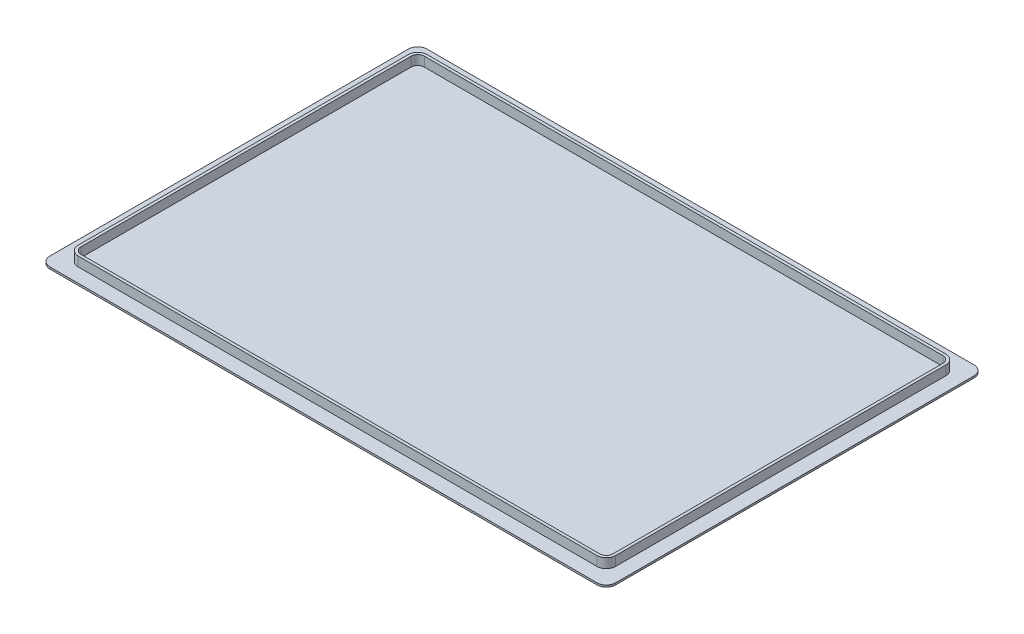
from build123d import *

# Parameters (mm, degrees)
AUFSATZ_LINEAR_AUSTRAGEN1_DEPTH = 2
LINEAR_AUSTRAGEN_D_NN1_DEPTH    = 10


with BuildPart() as part:
    # Skizze1 → Aufsatz-Linear austragen1 (new body)
    with BuildSketch(Plane(origin=(0, 0, 0), x_dir=(1, 0, 0), z_dir=(0, 1, 0))):
        with BuildLine():
            Line((-290, -200), (290, -200))
            ThreePointArc((290, -200), (297.071067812, -197.071067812), (300, -190))
            Line((300, -190), (300, 190))
            ThreePointArc((300, 190), (297.071067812, 197.071067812), (290, 200))
            Line((290, 200), (-290, 200))
            ThreePointArc((-290, 200), (-297.071067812, 197.071067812), (-300, 190))
            Line((-300, 190), (-300, -190))
            ThreePointArc((-300, -190), (-297.071067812, -197.071067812), (-290, -200))
        make_face()
    extrude(amount=AUFSATZ_LINEAR_AUSTRAGEN1_DEPTH)

    # Skizze2 → Linear-Austragen-D_nn1 (add)
    with BuildSketch(Plane(origin=(0, 2, 0), x_dir=(1, 0, 0), z_dir=(0, 1, 0))):
        with BuildLine():
            Line((-285, 175), (-285, -175))
            ThreePointArc((-285, -175), (-282.071067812, -182.071067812), (-275, -185))
            Line((-275, -185), (275, -185))
            ThreePointArc((275, -185), (282.071067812, -182.071067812), (285, -175))
            Line((285, -175), (285, 175))
            ThreePointArc((285, 175), (282.071067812, 182.071067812), (275, 185))
            Line((275, 185), (-275, 185))
            ThreePointArc((-275, 185), (-282.071067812, 182.071067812), (-285, 175))
        make_face()
        with BuildLine():
            Line((-282, 175), (-282, -175))
            ThreePointArc((-282, -175), (-279.949747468, -179.949747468), (-275, -182))
            Line((-275, -182), (275, -182))
            ThreePointArc((275, -182), (279.949747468, -179.949747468), (282, -175))
            Line((282, -175), (282, 175))
            ThreePointArc((282, 175), (279.949747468, 179.949747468), (275, 182))
            Line((275, 182), (-275, 182))
            ThreePointArc((-275, 182), (-279.949747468, 179.949747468), (-282, 175))
        make_face(mode=Mode.SUBTRACT)
    extrude(amount=LINEAR_AUSTRAGEN_D_NN1_DEPTH)


solid = part.part
